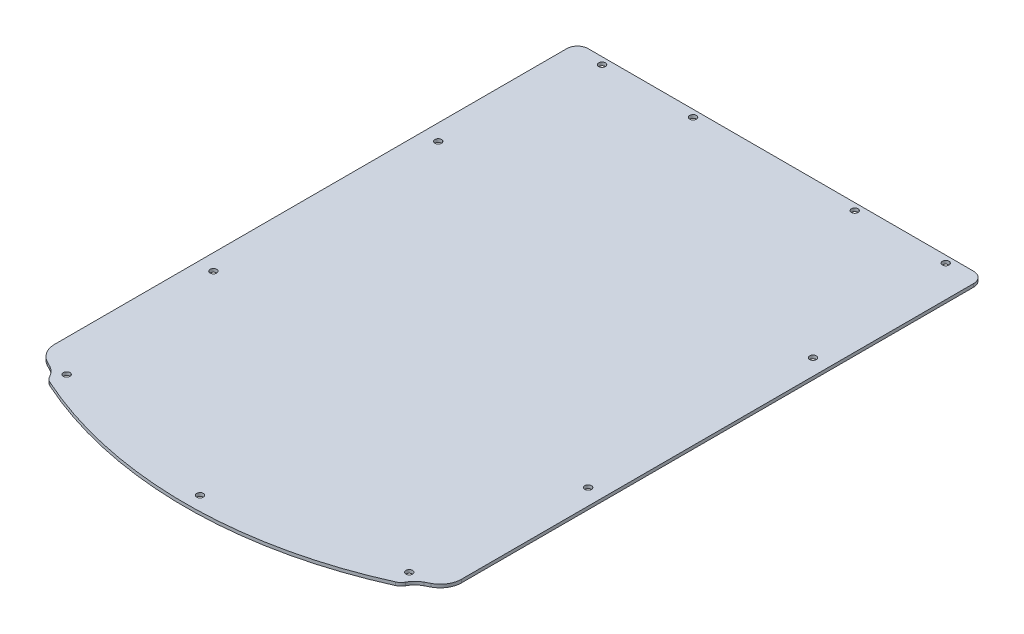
ISO-10303-21;
HEADER;
FILE_DESCRIPTION(('STEP AP214'),'2;1');
FILE_NAME('part.step','',(''),(''),'','','');
FILE_SCHEMA(('AUTOMOTIVE_DESIGN { 1 0 10303 214 1 1 1 1 }'));
ENDSEC;
DATA;
#1=APPLICATION_CONTEXT('core data for automotive mechanical design processes');
#2=APPLICATION_PROTOCOL_DEFINITION('international standard','automotive_design',2000,#1);
#3=PRODUCT_CONTEXT('',#1,'mechanical');
#4=PRODUCT('Part','Part','',(#3));
#5=PRODUCT_RELATED_PRODUCT_CATEGORY('part','',(#4));
#6=PRODUCT_DEFINITION_FORMATION('','',#4);
#7=PRODUCT_DEFINITION_CONTEXT('part definition',#1,'design');
#8=PRODUCT_DEFINITION('design','',#6,#7);
#9=PRODUCT_DEFINITION_SHAPE('','',#8);
#10=(LENGTH_UNIT() NAMED_UNIT(*) SI_UNIT(.MILLI.,.METRE.));
#11=(NAMED_UNIT(*) PLANE_ANGLE_UNIT() SI_UNIT($,.RADIAN.));
#12=(NAMED_UNIT(*) SI_UNIT($,.STERADIAN.) SOLID_ANGLE_UNIT());
#13=UNCERTAINTY_MEASURE_WITH_UNIT(LENGTH_MEASURE(1.E-05),#10,'distance_accuracy_value','');
#14=(GEOMETRIC_REPRESENTATION_CONTEXT(3) GLOBAL_UNCERTAINTY_ASSIGNED_CONTEXT((#13)) GLOBAL_UNIT_ASSIGNED_CONTEXT((#10,
#11,#12)) REPRESENTATION_CONTEXT('',''));
#15=CARTESIAN_POINT('',(0.,0.,0.));
#16=DIRECTION('',(0.,0.,1.));
#17=DIRECTION('',(1.,0.,0.));
#18=AXIS2_PLACEMENT_3D('',#15,#16,#17);
#19=CARTESIAN_POINT('',(0.,-1.5,-42.9999999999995));
#20=DIRECTION('',(0.,1.,0.));
#21=DIRECTION('',(0.,0.,1.));
#22=AXIS2_PLACEMENT_3D('',#19,#20,#21);
#23=CYLINDRICAL_SURFACE('',#22,193.);
#24=CARTESIAN_POINT('',(0.,-1.5,-42.9999999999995));
#25=DIRECTION('',(0.,1.,0.));
#26=DIRECTION('',(0.,0.,1.));
#27=AXIS2_PLACEMENT_3D('',#24,#25,#26);
#28=CIRCLE('',#27,193.);
#29=CARTESIAN_POINT('',(-89.6448087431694,-1.5,127.917548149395));
#30=VERTEX_POINT('',#29);
#31=CARTESIAN_POINT('',(-87.4520577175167,-1.5,129.049811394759));
#32=VERTEX_POINT('',#31);
#33=EDGE_CURVE('E302',#30,#32,#28,.T.);
#34=ORIENTED_EDGE('',*,*,#33,.T.);
#35=DIRECTION('',(0.,1.,0.));
#36=VECTOR('',#35,1.);
#37=CARTESIAN_POINT('',(-87.4520577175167,-1.5,129.049811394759));
#38=LINE('',#37,#36);
#39=CARTESIAN_POINT('',(-87.4520577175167,0.,129.049811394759));
#40=VERTEX_POINT('',#39);
#41=EDGE_CURVE('E169',#32,#40,#38,.T.);
#42=ORIENTED_EDGE('',*,*,#41,.T.);
#43=CARTESIAN_POINT('',(0.,0.,-42.9999999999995));
#44=DIRECTION('',(0.,1.,0.));
#45=DIRECTION('',(0.,0.,1.));
#46=AXIS2_PLACEMENT_3D('',#43,#44,#45);
#47=CIRCLE('',#46,193.);
#48=CARTESIAN_POINT('',(-89.6448087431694,0.,127.917548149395));
#49=VERTEX_POINT('',#48);
#50=EDGE_CURVE('E152',#49,#40,#47,.T.);
#51=ORIENTED_EDGE('',*,*,#50,.F.);
#52=DIRECTION('',(0.,1.,0.));
#53=VECTOR('',#52,1.);
#54=CARTESIAN_POINT('',(-89.6448087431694,-1.5,127.917548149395));
#55=LINE('',#54,#53);
#56=EDGE_CURVE('E166',#49,#30,#55,.F.);
#57=ORIENTED_EDGE('',*,*,#56,.T.);
#58=EDGE_LOOP('',(#34,#42,#51,#57));
#59=FACE_BOUND('',#58,.T.);
#60=ADVANCED_FACE('F44',(#59),#23,.T.);
#61=CARTESIAN_POINT('',(-94.9999999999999,-1.5,125.));
#62=DIRECTION('',(-1.,0.,0.));
#63=DIRECTION('',(0.,0.,1.));
#64=AXIS2_PLACEMENT_3D('',#61,#62,#63);
#65=PLANE('',#64);
#66=DIRECTION('',(0.,0.,1.));
#67=VECTOR('',#66,1.);
#68=CARTESIAN_POINT('',(-94.9999999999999,0.,125.));
#69=LINE('',#68,#67);
#70=CARTESIAN_POINT('',(-95.0000000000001,0.,-120.));
#71=VERTEX_POINT('',#70);
#72=CARTESIAN_POINT('',(-94.9999999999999,0.,119.061716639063));
#73=VERTEX_POINT('',#72);
#74=EDGE_CURVE('E154',#71,#73,#69,.T.);
#75=ORIENTED_EDGE('',*,*,#74,.F.);
#76=DIRECTION('',(0.,1.,0.));
#77=VECTOR('',#76,1.);
#78=CARTESIAN_POINT('',(-95.0000000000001,-1.5,-120.));
#79=LINE('',#78,#77);
#80=CARTESIAN_POINT('',(-95.0000000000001,-1.5,-120.));
#81=VERTEX_POINT('',#80);
#82=EDGE_CURVE('E255',#71,#81,#79,.F.);
#83=ORIENTED_EDGE('',*,*,#82,.T.);
#84=DIRECTION('',(0.,0.,1.));
#85=VECTOR('',#84,1.);
#86=CARTESIAN_POINT('',(-94.9999999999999,-1.5,125.));
#87=LINE('',#86,#85);
#88=CARTESIAN_POINT('',(-94.9999999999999,-1.5,119.061716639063));
#89=VERTEX_POINT('',#88);
#90=EDGE_CURVE('E297',#81,#89,#87,.T.);
#91=ORIENTED_EDGE('',*,*,#90,.T.);
#92=DIRECTION('',(0.,1.,0.));
#93=VECTOR('',#92,1.);
#94=CARTESIAN_POINT('',(-94.9999999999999,-1.5,119.061716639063));
#95=LINE('',#94,#93);
#96=EDGE_CURVE('E198',#89,#73,#95,.T.);
#97=ORIENTED_EDGE('',*,*,#96,.T.);
#98=EDGE_LOOP('',(#75,#83,#91,#97));
#99=FACE_BOUND('',#98,.T.);
#100=ADVANCED_FACE('F344',(#99),#65,.T.);
#101=CARTESIAN_POINT('',(94.9999999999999,-1.5,-125.));
#102=DIRECTION('',(0.,0.,-1.));
#103=DIRECTION('',(-1.,0.,0.));
#104=AXIS2_PLACEMENT_3D('',#101,#102,#103);
#105=PLANE('',#104);
#106=DIRECTION('',(-1.,0.,0.));
#107=VECTOR('',#106,1.);
#108=CARTESIAN_POINT('',(94.9999999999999,0.,-125.));
#109=LINE('',#108,#107);
#110=CARTESIAN_POINT('',(89.9999999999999,0.,-125.));
#111=VERTEX_POINT('',#110);
#112=CARTESIAN_POINT('',(-90.0000000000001,0.,-125.));
#113=VERTEX_POINT('',#112);
#114=EDGE_CURVE('E189',#111,#113,#109,.T.);
#115=ORIENTED_EDGE('',*,*,#114,.F.);
#116=DIRECTION('',(0.,1.,0.));
#117=VECTOR('',#116,1.);
#118=CARTESIAN_POINT('',(89.9999999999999,-1.5,-125.));
#119=LINE('',#118,#117);
#120=CARTESIAN_POINT('',(89.9999999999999,-1.5,-125.));
#121=VERTEX_POINT('',#120);
#122=EDGE_CURVE('E242',#111,#121,#119,.F.);
#123=ORIENTED_EDGE('',*,*,#122,.T.);
#124=DIRECTION('',(-1.,0.,0.));
#125=VECTOR('',#124,1.);
#126=CARTESIAN_POINT('',(94.9999999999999,-1.5,-125.));
#127=LINE('',#126,#125);
#128=CARTESIAN_POINT('',(-90.0000000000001,-1.5,-125.));
#129=VERTEX_POINT('',#128);
#130=EDGE_CURVE('E179',#121,#129,#127,.T.);
#131=ORIENTED_EDGE('',*,*,#130,.T.);
#132=DIRECTION('',(0.,1.,0.));
#133=VECTOR('',#132,1.);
#134=CARTESIAN_POINT('',(-90.0000000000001,-1.5,-125.));
#135=LINE('',#134,#133);
#136=EDGE_CURVE('E238',#129,#113,#135,.T.);
#137=ORIENTED_EDGE('',*,*,#136,.T.);
#138=EDGE_LOOP('',(#115,#123,#131,#137));
#139=FACE_BOUND('',#138,.T.);
#140=ADVANCED_FACE('F316',(#139),#105,.T.);
#141=CARTESIAN_POINT('',(94.9999999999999,-1.5,125.));
#142=DIRECTION('',(1.,0.,0.));
#143=DIRECTION('',(0.,0.,-1.));
#144=AXIS2_PLACEMENT_3D('',#141,#142,#143);
#145=PLANE('',#144);
#146=DIRECTION('',(0.,0.,-1.));
#147=VECTOR('',#146,1.);
#148=CARTESIAN_POINT('',(94.9999999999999,-1.5,125.));
#149=LINE('',#148,#147);
#150=CARTESIAN_POINT('',(94.9999999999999,-1.5,119.061716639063));
#151=VERTEX_POINT('',#150);
#152=CARTESIAN_POINT('',(94.9999999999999,-1.5,-120.));
#153=VERTEX_POINT('',#152);
#154=EDGE_CURVE('E186',#151,#153,#149,.T.);
#155=ORIENTED_EDGE('',*,*,#154,.T.);
#156=DIRECTION('',(0.,1.,0.));
#157=VECTOR('',#156,1.);
#158=CARTESIAN_POINT('',(94.9999999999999,-1.5,-120.));
#159=LINE('',#158,#157);
#160=CARTESIAN_POINT('',(94.9999999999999,0.,-120.));
#161=VERTEX_POINT('',#160);
#162=EDGE_CURVE('E222',#153,#161,#159,.T.);
#163=ORIENTED_EDGE('',*,*,#162,.T.);
#164=DIRECTION('',(0.,0.,-1.));
#165=VECTOR('',#164,1.);
#166=CARTESIAN_POINT('',(94.9999999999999,0.,125.));
#167=LINE('',#166,#165);
#168=CARTESIAN_POINT('',(94.9999999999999,0.,119.061716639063));
#169=VERTEX_POINT('',#168);
#170=EDGE_CURVE('E171',#169,#161,#167,.T.);
#171=ORIENTED_EDGE('',*,*,#170,.F.);
#172=DIRECTION('',(0.,1.,0.));
#173=VECTOR('',#172,1.);
#174=CARTESIAN_POINT('',(94.9999999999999,-1.5,119.061716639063));
#175=LINE('',#174,#173);
#176=EDGE_CURVE('E207',#169,#151,#175,.F.);
#177=ORIENTED_EDGE('',*,*,#176,.T.);
#178=EDGE_LOOP('',(#155,#163,#171,#177));
#179=FACE_BOUND('',#178,.T.);
#180=ADVANCED_FACE('F325',(#179),#145,.T.);
#181=CARTESIAN_POINT('',(87.4520577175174,0.,129.049811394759));
#182=VERTEX_POINT('',#181);
#183=CARTESIAN_POINT('',(89.6448087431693,0.,127.917548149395));
#184=VERTEX_POINT('',#183);
#185=EDGE_CURVE('E172',#182,#184,#47,.T.);
#186=ORIENTED_EDGE('',*,*,#185,.F.);
#187=DIRECTION('',(0.,1.,0.));
#188=VECTOR('',#187,1.);
#189=CARTESIAN_POINT('',(87.4520577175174,-1.5,129.049811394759));
#190=LINE('',#189,#188);
#191=CARTESIAN_POINT('',(87.4520577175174,-1.5,129.049811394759));
#192=VERTEX_POINT('',#191);
#193=EDGE_CURVE('E195',#182,#192,#190,.F.);
#194=ORIENTED_EDGE('',*,*,#193,.T.);
#195=CARTESIAN_POINT('',(89.6448087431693,-1.5,127.917548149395));
#196=VERTEX_POINT('',#195);
#197=EDGE_CURVE('E276',#192,#196,#28,.T.);
#198=ORIENTED_EDGE('',*,*,#197,.T.);
#199=DIRECTION('',(0.,1.,0.));
#200=VECTOR('',#199,1.);
#201=CARTESIAN_POINT('',(89.6448087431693,-1.5,127.917548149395));
#202=LINE('',#201,#200);
#203=EDGE_CURVE('E183',#196,#184,#202,.T.);
#204=ORIENTED_EDGE('',*,*,#203,.T.);
#205=EDGE_LOOP('',(#186,#194,#198,#204));
#206=FACE_BOUND('',#205,.T.);
#207=ADVANCED_FACE('F332',(#206),#23,.T.);
#208=CARTESIAN_POINT('',(0.,-1.5,-42.9999999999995));
#209=DIRECTION('',(0.,1.,0.));
#210=DIRECTION('',(0.,0.,1.));
#211=AXIS2_PLACEMENT_3D('',#208,#209,#210);
#212=PLANE('',#211);
#213=CARTESIAN_POINT('',(-87.5000000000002,-1.5,52.5000000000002));
#214=DIRECTION('',(0.,-1.,0.));
#215=DIRECTION('',(0.,0.,-1.));
#216=AXIS2_PLACEMENT_3D('',#213,#214,#215);
#217=CIRCLE('',#216,1.54999999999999);
#218=CARTESIAN_POINT('',(-87.5000000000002,-1.5,50.9500000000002));
#219=VERTEX_POINT('',#218);
#220=EDGE_CURVE('E499',#219,#219,#217,.T.);
#221=ORIENTED_EDGE('',*,*,#220,.F.);
#222=EDGE_LOOP('',(#221));
#223=FACE_BOUND('',#222,.T.);
#224=CARTESIAN_POINT('',(-87.5000000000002,-1.5,-52.4999999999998));
#225=DIRECTION('',(0.,-1.,0.));
#226=DIRECTION('',(0.,0.,-1.));
#227=AXIS2_PLACEMENT_3D('',#224,#225,#226);
#228=CIRCLE('',#227,1.54999999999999);
#229=CARTESIAN_POINT('',(-87.5000000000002,-1.5,-54.0499999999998));
#230=VERTEX_POINT('',#229);
#231=EDGE_CURVE('E493',#230,#230,#228,.T.);
#232=ORIENTED_EDGE('',*,*,#231,.F.);
#233=EDGE_LOOP('',(#232));
#234=FACE_BOUND('',#233,.T.);
#235=CARTESIAN_POINT('',(-80.2500000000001,-1.5,-121.75));
#236=DIRECTION('',(0.,-1.,0.));
#237=DIRECTION('',(0.,0.,-1.));
#238=AXIS2_PLACEMENT_3D('',#235,#236,#237);
#239=CIRCLE('',#238,1.54999999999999);
#240=CARTESIAN_POINT('',(-80.2500000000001,-1.5,-123.3));
#241=VERTEX_POINT('',#240);
#242=EDGE_CURVE('E487',#241,#241,#239,.T.);
#243=ORIENTED_EDGE('',*,*,#242,.F.);
#244=EDGE_LOOP('',(#243));
#245=FACE_BOUND('',#244,.T.);
#246=CARTESIAN_POINT('',(-37.7500000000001,-1.5,-121.75));
#247=DIRECTION('',(0.,-1.,0.));
#248=DIRECTION('',(0.,0.,-1.));
#249=AXIS2_PLACEMENT_3D('',#246,#247,#248);
#250=CIRCLE('',#249,1.55);
#251=CARTESIAN_POINT('',(-37.7500000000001,-1.5,-123.3));
#252=VERTEX_POINT('',#251);
#253=EDGE_CURVE('E481',#252,#252,#250,.T.);
#254=ORIENTED_EDGE('',*,*,#253,.F.);
#255=EDGE_LOOP('',(#254));
#256=FACE_BOUND('',#255,.T.);
#257=CARTESIAN_POINT('',(37.7499999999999,-1.5,-121.75));
#258=DIRECTION('',(0.,-1.,0.));
#259=DIRECTION('',(0.,0.,-1.));
#260=AXIS2_PLACEMENT_3D('',#257,#258,#259);
#261=CIRCLE('',#260,1.55);
#262=CARTESIAN_POINT('',(37.7499999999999,-1.5,-123.3));
#263=VERTEX_POINT('',#262);
#264=EDGE_CURVE('E475',#263,#263,#261,.T.);
#265=ORIENTED_EDGE('',*,*,#264,.F.);
#266=EDGE_LOOP('',(#265));
#267=FACE_BOUND('',#266,.T.);
#268=CARTESIAN_POINT('',(80.2499999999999,-1.5,-121.75));
#269=DIRECTION('',(0.,-1.,0.));
#270=DIRECTION('',(0.,0.,-1.));
#271=AXIS2_PLACEMENT_3D('',#268,#269,#270);
#272=CIRCLE('',#271,1.54999999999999);
#273=CARTESIAN_POINT('',(80.2499999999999,-1.5,-123.3));
#274=VERTEX_POINT('',#273);
#275=EDGE_CURVE('E469',#274,#274,#272,.T.);
#276=ORIENTED_EDGE('',*,*,#275,.F.);
#277=EDGE_LOOP('',(#276));
#278=FACE_BOUND('',#277,.T.);
#279=CARTESIAN_POINT('',(87.5000000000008,-1.5,-52.4999999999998));
#280=DIRECTION('',(0.,-1.,0.));
#281=DIRECTION('',(0.,0.,-1.));
#282=AXIS2_PLACEMENT_3D('',#279,#280,#281);
#283=CIRCLE('',#282,1.54999999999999);
#284=CARTESIAN_POINT('',(87.5000000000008,-1.5,-54.0499999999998));
#285=VERTEX_POINT('',#284);
#286=EDGE_CURVE('E463',#285,#285,#283,.T.);
#287=ORIENTED_EDGE('',*,*,#286,.F.);
#288=EDGE_LOOP('',(#287));
#289=FACE_BOUND('',#288,.T.);
#290=CARTESIAN_POINT('',(87.5000000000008,-1.5,52.5000000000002));
#291=DIRECTION('',(0.,-1.,0.));
#292=DIRECTION('',(0.,0.,-1.));
#293=AXIS2_PLACEMENT_3D('',#290,#291,#292);
#294=CIRCLE('',#293,1.54999999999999);
#295=CARTESIAN_POINT('',(87.5000000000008,-1.5,50.9500000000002));
#296=VERTEX_POINT('',#295);
#297=EDGE_CURVE('E457',#296,#296,#294,.T.);
#298=ORIENTED_EDGE('',*,*,#297,.F.);
#299=EDGE_LOOP('',(#298));
#300=FACE_BOUND('',#299,.T.);
#301=CARTESIAN_POINT('',(79.9805060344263,-1.5,128.518748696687));
#302=DIRECTION('',(0.,-1.,0.));
#303=DIRECTION('',(0.,0.,-1.));
#304=AXIS2_PLACEMENT_3D('',#301,#302,#303);
#305=CIRCLE('',#304,1.54999999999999);
#306=CARTESIAN_POINT('',(79.9805060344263,-1.5,126.968748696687));
#307=VERTEX_POINT('',#306);
#308=EDGE_CURVE('E446',#307,#307,#305,.T.);
#309=ORIENTED_EDGE('',*,*,#308,.F.);
#310=EDGE_LOOP('',(#309));
#311=FACE_BOUND('',#310,.T.);
#312=CARTESIAN_POINT('',(0.,-1.5,146.25));
#313=DIRECTION('',(0.,-1.,0.));
#314=DIRECTION('',(0.,0.,-1.));
#315=AXIS2_PLACEMENT_3D('',#312,#313,#314);
#316=CIRCLE('',#315,1.55);
#317=CARTESIAN_POINT('',(0.,-1.5,144.7));
#318=VERTEX_POINT('',#317);
#319=EDGE_CURVE('E445',#318,#318,#316,.T.);
#320=ORIENTED_EDGE('',*,*,#319,.F.);
#321=EDGE_LOOP('',(#320));
#322=FACE_BOUND('',#321,.T.);
#323=CARTESIAN_POINT('',(-79.9805060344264,-1.5,128.518748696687));
#324=DIRECTION('',(0.,-1.,0.));
#325=DIRECTION('',(0.,0.,-1.));
#326=AXIS2_PLACEMENT_3D('',#323,#324,#325);
#327=CIRCLE('',#326,1.54999999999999);
#328=CARTESIAN_POINT('',(-79.9805060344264,-1.5,126.968748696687));
#329=VERTEX_POINT('',#328);
#330=EDGE_CURVE('E293',#329,#329,#327,.T.);
#331=ORIENTED_EDGE('',*,*,#330,.F.);
#332=EDGE_LOOP('',(#331));
#333=FACE_BOUND('',#332,.T.);
#334=ORIENTED_EDGE('',*,*,#130,.F.);
#335=CARTESIAN_POINT('',(89.9999999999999,-1.5,-120.));
#336=DIRECTION('',(0.,1.,0.));
#337=DIRECTION('',(0.,0.,1.));
#338=AXIS2_PLACEMENT_3D('',#335,#336,#337);
#339=CIRCLE('',#338,5.);
#340=EDGE_CURVE('E252',#121,#153,#339,.F.);
#341=ORIENTED_EDGE('',*,*,#340,.T.);
#342=ORIENTED_EDGE('',*,*,#154,.F.);
#343=CARTESIAN_POINT('',(84.9999999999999,-1.5,119.061716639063));
#344=DIRECTION('',(0.,1.,0.));
#345=DIRECTION('',(0.,0.,1.));
#346=AXIS2_PLACEMENT_3D('',#343,#344,#345);
#347=CIRCLE('',#346,10.);
#348=EDGE_CURVE('E160',#151,#196,#347,.F.);
#349=ORIENTED_EDGE('',*,*,#348,.T.);
#350=ORIENTED_EDGE('',*,*,#197,.F.);
#351=CARTESIAN_POINT('',(91.9832524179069,-1.5,137.964309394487));
#352=DIRECTION('',(0.,1.,0.));
#353=DIRECTION('',(0.,0.,1.));
#354=AXIS2_PLACEMENT_3D('',#351,#352,#353);
#355=CIRCLE('',#354,10.);
#356=CARTESIAN_POINT('',(83.1111833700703,-1.5,133.35059171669));
#357=VERTEX_POINT('',#356);
#358=EDGE_CURVE('E219',#192,#357,#355,.T.);
#359=ORIENTED_EDGE('',*,*,#358,.T.);
#360=CARTESIAN_POINT('',(78.6751488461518,-1.5,131.043732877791));
#361=DIRECTION('',(0.,1.,0.));
#362=DIRECTION('',(0.,0.,1.));
#363=AXIS2_PLACEMENT_3D('',#360,#361,#362);
#364=CIRCLE('',#363,5.);
#365=CARTESIAN_POINT('',(80.73470771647,-1.5,135.599851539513));
#366=VERTEX_POINT('',#365);
#367=EDGE_CURVE('E66',#357,#366,#364,.F.);
#368=ORIENTED_EDGE('',*,*,#367,.T.);
#369=CARTESIAN_POINT('',(0.,-1.5,-42.9999999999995));
#370=DIRECTION('',(0.,1.,0.));
#371=DIRECTION('',(0.,0.,1.));
#372=AXIS2_PLACEMENT_3D('',#369,#370,#371);
#373=CIRCLE('',#372,196.);
#374=CARTESIAN_POINT('',(-80.7347077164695,-1.5,135.599851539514));
#375=VERTEX_POINT('',#374);
#376=EDGE_CURVE('E285',#375,#366,#373,.T.);
#377=ORIENTED_EDGE('',*,*,#376,.F.);
#378=CARTESIAN_POINT('',(-78.6751488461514,-1.5,131.043732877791));
#379=DIRECTION('',(0.,1.,0.));
#380=DIRECTION('',(0.,0.,1.));
#381=AXIS2_PLACEMENT_3D('',#378,#379,#380);
#382=CIRCLE('',#381,5.);
#383=CARTESIAN_POINT('',(-83.1111833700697,-1.5,133.35059171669));
#384=VERTEX_POINT('',#383);
#385=EDGE_CURVE('E60',#375,#384,#382,.F.);
#386=ORIENTED_EDGE('',*,*,#385,.T.);
#387=CARTESIAN_POINT('',(-91.9832524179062,-1.5,137.964309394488));
#388=DIRECTION('',(0.,1.,0.));
#389=DIRECTION('',(0.,0.,1.));
#390=AXIS2_PLACEMENT_3D('',#387,#388,#389);
#391=CIRCLE('',#390,10.);
#392=EDGE_CURVE('E213',#384,#32,#391,.T.);
#393=ORIENTED_EDGE('',*,*,#392,.T.);
#394=ORIENTED_EDGE('',*,*,#33,.F.);
#395=CARTESIAN_POINT('',(-85.,-1.5,119.061716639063));
#396=DIRECTION('',(0.,1.,0.));
#397=DIRECTION('',(0.,0.,1.));
#398=AXIS2_PLACEMENT_3D('',#395,#396,#397);
#399=CIRCLE('',#398,10.);
#400=EDGE_CURVE('E177',#30,#89,#399,.F.);
#401=ORIENTED_EDGE('',*,*,#400,.T.);
#402=ORIENTED_EDGE('',*,*,#90,.F.);
#403=CARTESIAN_POINT('',(-90.0000000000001,-1.5,-120.));
#404=DIRECTION('',(0.,1.,0.));
#405=DIRECTION('',(0.,0.,1.));
#406=AXIS2_PLACEMENT_3D('',#403,#404,#405);
#407=CIRCLE('',#406,5.);
#408=EDGE_CURVE('E249',#81,#129,#407,.F.);
#409=ORIENTED_EDGE('',*,*,#408,.T.);
#410=EDGE_LOOP('',(#334,#341,#342,#349,#350,#359,#368,#377,#386,#393,#394,#401,#402,#409));
#411=FACE_BOUND('',#410,.T.);
#412=ADVANCED_FACE('F274',(#223,#234,#245,#256,#267,#278,#289,#300,#311,#322,#333,#411),#212,.F.);
#413=CARTESIAN_POINT('',(0.,0.,-42.9999999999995));
#414=DIRECTION('',(0.,1.,0.));
#415=DIRECTION('',(0.,0.,1.));
#416=AXIS2_PLACEMENT_3D('',#413,#414,#415);
#417=PLANE('',#416);
#418=CARTESIAN_POINT('',(-87.5000000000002,0.,52.5000000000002));
#419=DIRECTION('',(0.,-1.,0.));
#420=DIRECTION('',(0.,0.,-1.));
#421=AXIS2_PLACEMENT_3D('',#418,#419,#420);
#422=CIRCLE('',#421,1.54999999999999);
#423=CARTESIAN_POINT('',(-87.5000000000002,0.,50.9500000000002));
#424=VERTEX_POINT('',#423);
#425=EDGE_CURVE('E407',#424,#424,#422,.T.);
#426=ORIENTED_EDGE('',*,*,#425,.T.);
#427=EDGE_LOOP('',(#426));
#428=FACE_BOUND('',#427,.T.);
#429=CARTESIAN_POINT('',(-87.5000000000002,0.,-52.4999999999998));
#430=DIRECTION('',(0.,-1.,0.));
#431=DIRECTION('',(0.,0.,-1.));
#432=AXIS2_PLACEMENT_3D('',#429,#430,#431);
#433=CIRCLE('',#432,1.54999999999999);
#434=CARTESIAN_POINT('',(-87.5000000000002,0.,-54.0499999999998));
#435=VERTEX_POINT('',#434);
#436=EDGE_CURVE('E411',#435,#435,#433,.T.);
#437=ORIENTED_EDGE('',*,*,#436,.T.);
#438=EDGE_LOOP('',(#437));
#439=FACE_BOUND('',#438,.T.);
#440=CARTESIAN_POINT('',(-80.2500000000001,0.,-121.75));
#441=DIRECTION('',(0.,-1.,0.));
#442=DIRECTION('',(0.,0.,-1.));
#443=AXIS2_PLACEMENT_3D('',#440,#441,#442);
#444=CIRCLE('',#443,1.54999999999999);
#445=CARTESIAN_POINT('',(-80.2500000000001,0.,-123.3));
#446=VERTEX_POINT('',#445);
#447=EDGE_CURVE('E415',#446,#446,#444,.T.);
#448=ORIENTED_EDGE('',*,*,#447,.T.);
#449=EDGE_LOOP('',(#448));
#450=FACE_BOUND('',#449,.T.);
#451=CARTESIAN_POINT('',(-37.7500000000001,0.,-121.75));
#452=DIRECTION('',(0.,-1.,0.));
#453=DIRECTION('',(0.,0.,-1.));
#454=AXIS2_PLACEMENT_3D('',#451,#452,#453);
#455=CIRCLE('',#454,1.55);
#456=CARTESIAN_POINT('',(-37.7500000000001,0.,-123.3));
#457=VERTEX_POINT('',#456);
#458=EDGE_CURVE('E419',#457,#457,#455,.T.);
#459=ORIENTED_EDGE('',*,*,#458,.T.);
#460=EDGE_LOOP('',(#459));
#461=FACE_BOUND('',#460,.T.);
#462=CARTESIAN_POINT('',(37.7499999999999,0.,-121.75));
#463=DIRECTION('',(0.,-1.,0.));
#464=DIRECTION('',(0.,0.,-1.));
#465=AXIS2_PLACEMENT_3D('',#462,#463,#464);
#466=CIRCLE('',#465,1.55);
#467=CARTESIAN_POINT('',(37.7499999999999,0.,-123.3));
#468=VERTEX_POINT('',#467);
#469=EDGE_CURVE('E423',#468,#468,#466,.T.);
#470=ORIENTED_EDGE('',*,*,#469,.T.);
#471=EDGE_LOOP('',(#470));
#472=FACE_BOUND('',#471,.T.);
#473=CARTESIAN_POINT('',(80.2499999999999,0.,-121.75));
#474=DIRECTION('',(0.,-1.,0.));
#475=DIRECTION('',(0.,0.,-1.));
#476=AXIS2_PLACEMENT_3D('',#473,#474,#475);
#477=CIRCLE('',#476,1.54999999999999);
#478=CARTESIAN_POINT('',(80.2499999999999,0.,-123.3));
#479=VERTEX_POINT('',#478);
#480=EDGE_CURVE('E427',#479,#479,#477,.T.);
#481=ORIENTED_EDGE('',*,*,#480,.T.);
#482=EDGE_LOOP('',(#481));
#483=FACE_BOUND('',#482,.T.);
#484=CARTESIAN_POINT('',(87.5000000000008,0.,-52.4999999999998));
#485=DIRECTION('',(0.,-1.,0.));
#486=DIRECTION('',(0.,0.,-1.));
#487=AXIS2_PLACEMENT_3D('',#484,#485,#486);
#488=CIRCLE('',#487,1.54999999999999);
#489=CARTESIAN_POINT('',(87.5000000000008,0.,-54.0499999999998));
#490=VERTEX_POINT('',#489);
#491=EDGE_CURVE('E431',#490,#490,#488,.T.);
#492=ORIENTED_EDGE('',*,*,#491,.T.);
#493=EDGE_LOOP('',(#492));
#494=FACE_BOUND('',#493,.T.);
#495=CARTESIAN_POINT('',(87.5000000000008,0.,52.5000000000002));
#496=DIRECTION('',(0.,-1.,0.));
#497=DIRECTION('',(0.,0.,-1.));
#498=AXIS2_PLACEMENT_3D('',#495,#496,#497);
#499=CIRCLE('',#498,1.54999999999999);
#500=CARTESIAN_POINT('',(87.5000000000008,0.,50.9500000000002));
#501=VERTEX_POINT('',#500);
#502=EDGE_CURVE('E435',#501,#501,#499,.T.);
#503=ORIENTED_EDGE('',*,*,#502,.T.);
#504=EDGE_LOOP('',(#503));
#505=FACE_BOUND('',#504,.T.);
#506=CARTESIAN_POINT('',(79.9805060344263,0.,128.518748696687));
#507=DIRECTION('',(0.,-1.,0.));
#508=DIRECTION('',(0.,0.,-1.));
#509=AXIS2_PLACEMENT_3D('',#506,#507,#508);
#510=CIRCLE('',#509,1.54999999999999);
#511=CARTESIAN_POINT('',(79.9805060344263,0.,126.968748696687));
#512=VERTEX_POINT('',#511);
#513=EDGE_CURVE('E439',#512,#512,#510,.T.);
#514=ORIENTED_EDGE('',*,*,#513,.T.);
#515=EDGE_LOOP('',(#514));
#516=FACE_BOUND('',#515,.T.);
#517=CARTESIAN_POINT('',(0.,0.,146.25));
#518=DIRECTION('',(0.,-1.,0.));
#519=DIRECTION('',(0.,0.,-1.));
#520=AXIS2_PLACEMENT_3D('',#517,#518,#519);
#521=CIRCLE('',#520,1.55);
#522=CARTESIAN_POINT('',(0.,0.,144.7));
#523=VERTEX_POINT('',#522);
#524=EDGE_CURVE('E443',#523,#523,#521,.T.);
#525=ORIENTED_EDGE('',*,*,#524,.T.);
#526=EDGE_LOOP('',(#525));
#527=FACE_BOUND('',#526,.T.);
#528=CARTESIAN_POINT('',(-79.9805060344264,0.,128.518748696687));
#529=DIRECTION('',(0.,-1.,0.));
#530=DIRECTION('',(0.,0.,-1.));
#531=AXIS2_PLACEMENT_3D('',#528,#529,#530);
#532=CIRCLE('',#531,1.54999999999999);
#533=CARTESIAN_POINT('',(-79.9805060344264,0.,126.968748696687));
#534=VERTEX_POINT('',#533);
#535=EDGE_CURVE('E287',#534,#534,#532,.T.);
#536=ORIENTED_EDGE('',*,*,#535,.T.);
#537=EDGE_LOOP('',(#536));
#538=FACE_BOUND('',#537,.T.);
#539=ORIENTED_EDGE('',*,*,#170,.T.);
#540=CARTESIAN_POINT('',(89.9999999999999,0.,-120.));
#541=DIRECTION('',(0.,1.,0.));
#542=DIRECTION('',(0.,0.,1.));
#543=AXIS2_PLACEMENT_3D('',#540,#541,#542);
#544=CIRCLE('',#543,5.);
#545=EDGE_CURVE('E235',#161,#111,#544,.T.);
#546=ORIENTED_EDGE('',*,*,#545,.T.);
#547=ORIENTED_EDGE('',*,*,#114,.T.);
#548=CARTESIAN_POINT('',(-90.0000000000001,0.,-120.));
#549=DIRECTION('',(0.,1.,0.));
#550=DIRECTION('',(0.,0.,1.));
#551=AXIS2_PLACEMENT_3D('',#548,#549,#550);
#552=CIRCLE('',#551,5.);
#553=EDGE_CURVE('E232',#113,#71,#552,.T.);
#554=ORIENTED_EDGE('',*,*,#553,.T.);
#555=ORIENTED_EDGE('',*,*,#74,.T.);
#556=CARTESIAN_POINT('',(-85.,0.,119.061716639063));
#557=DIRECTION('',(0.,1.,0.));
#558=DIRECTION('',(0.,0.,1.));
#559=AXIS2_PLACEMENT_3D('',#556,#557,#558);
#560=CIRCLE('',#559,10.);
#561=EDGE_CURVE('E147',#73,#49,#560,.T.);
#562=ORIENTED_EDGE('',*,*,#561,.T.);
#563=ORIENTED_EDGE('',*,*,#50,.T.);
#564=CARTESIAN_POINT('',(-91.9832524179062,0.,137.964309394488));
#565=DIRECTION('',(0.,1.,0.));
#566=DIRECTION('',(0.,0.,1.));
#567=AXIS2_PLACEMENT_3D('',#564,#565,#566);
#568=CIRCLE('',#567,10.);
#569=CARTESIAN_POINT('',(-83.1111833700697,0.,133.35059171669));
#570=VERTEX_POINT('',#569);
#571=EDGE_CURVE('E210',#40,#570,#568,.F.);
#572=ORIENTED_EDGE('',*,*,#571,.T.);
#573=CARTESIAN_POINT('',(-78.6751488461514,0.,131.043732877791));
#574=DIRECTION('',(0.,1.,0.));
#575=DIRECTION('',(0.,0.,1.));
#576=AXIS2_PLACEMENT_3D('',#573,#574,#575);
#577=CIRCLE('',#576,5.);
#578=CARTESIAN_POINT('',(-80.7347077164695,0.,135.599851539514));
#579=VERTEX_POINT('',#578);
#580=EDGE_CURVE('E226',#570,#579,#577,.T.);
#581=ORIENTED_EDGE('',*,*,#580,.T.);
#582=CARTESIAN_POINT('',(0.,0.,-42.9999999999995));
#583=DIRECTION('',(0.,1.,0.));
#584=DIRECTION('',(0.,0.,1.));
#585=AXIS2_PLACEMENT_3D('',#582,#583,#584);
#586=CIRCLE('',#585,196.);
#587=CARTESIAN_POINT('',(80.73470771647,0.,135.599851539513));
#588=VERTEX_POINT('',#587);
#589=EDGE_CURVE('E283',#579,#588,#586,.T.);
#590=ORIENTED_EDGE('',*,*,#589,.T.);
#591=CARTESIAN_POINT('',(78.6751488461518,0.,131.043732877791));
#592=DIRECTION('',(0.,1.,0.));
#593=DIRECTION('',(0.,0.,1.));
#594=AXIS2_PLACEMENT_3D('',#591,#592,#593);
#595=CIRCLE('',#594,5.);
#596=CARTESIAN_POINT('',(83.1111833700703,0.,133.35059171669));
#597=VERTEX_POINT('',#596);
#598=EDGE_CURVE('E229',#588,#597,#595,.T.);
#599=ORIENTED_EDGE('',*,*,#598,.T.);
#600=CARTESIAN_POINT('',(91.9832524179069,0.,137.964309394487));
#601=DIRECTION('',(0.,1.,0.));
#602=DIRECTION('',(0.,0.,1.));
#603=AXIS2_PLACEMENT_3D('',#600,#601,#602);
#604=CIRCLE('',#603,10.);
#605=EDGE_CURVE('E216',#597,#182,#604,.F.);
#606=ORIENTED_EDGE('',*,*,#605,.T.);
#607=ORIENTED_EDGE('',*,*,#185,.T.);
#608=CARTESIAN_POINT('',(84.9999999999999,0.,119.061716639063));
#609=DIRECTION('',(0.,1.,0.));
#610=DIRECTION('',(0.,0.,1.));
#611=AXIS2_PLACEMENT_3D('',#608,#609,#610);
#612=CIRCLE('',#611,10.);
#613=EDGE_CURVE('E161',#184,#169,#612,.T.);
#614=ORIENTED_EDGE('',*,*,#613,.T.);
#615=EDGE_LOOP('',(#539,#546,#547,#554,#555,#562,#563,#572,#581,#590,#599,#606,#607,#614));
#616=FACE_BOUND('',#615,.T.);
#617=ADVANCED_FACE('F150',(#428,#439,#450,#461,#472,#483,#494,#505,#516,#527,#538,#616),#417,.T.);
#618=CARTESIAN_POINT('',(0.,-1.5,-42.9999999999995));
#619=DIRECTION('',(0.,1.,0.));
#620=DIRECTION('',(0.,0.,1.));
#621=AXIS2_PLACEMENT_3D('',#618,#619,#620);
#622=CYLINDRICAL_SURFACE('',#621,196.);
#623=ORIENTED_EDGE('',*,*,#376,.T.);
#624=DIRECTION('',(0.,1.,0.));
#625=VECTOR('',#624,1.);
#626=CARTESIAN_POINT('',(80.73470771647,-1.5,135.599851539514));
#627=LINE('',#626,#625);
#628=EDGE_CURVE('E261',#366,#588,#627,.T.);
#629=ORIENTED_EDGE('',*,*,#628,.T.);
#630=ORIENTED_EDGE('',*,*,#589,.F.);
#631=DIRECTION('',(0.,1.,0.));
#632=VECTOR('',#631,1.);
#633=CARTESIAN_POINT('',(-80.7347077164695,-1.5,135.599851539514));
#634=LINE('',#633,#632);
#635=EDGE_CURVE('E258',#579,#375,#634,.F.);
#636=ORIENTED_EDGE('',*,*,#635,.T.);
#637=EDGE_LOOP('',(#623,#629,#630,#636));
#638=FACE_BOUND('',#637,.T.);
#639=ADVANCED_FACE('F282',(#638),#622,.T.);
#640=CARTESIAN_POINT('',(-91.9832524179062,-1.5,137.964309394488));
#641=DIRECTION('',(0.,-1.,0.));
#642=DIRECTION('',(0.,0.,-1.));
#643=AXIS2_PLACEMENT_3D('',#640,#641,#642);
#644=CYLINDRICAL_SURFACE('',#643,10.);
#645=ORIENTED_EDGE('',*,*,#392,.F.);
#646=DIRECTION('',(0.,-1.,0.));
#647=VECTOR('',#646,1.);
#648=CARTESIAN_POINT('',(-83.1111833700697,-1.5,133.35059171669));
#649=LINE('',#648,#647);
#650=EDGE_CURVE('E11',#384,#570,#649,.F.);
#651=ORIENTED_EDGE('',*,*,#650,.T.);
#652=ORIENTED_EDGE('',*,*,#571,.F.);
#653=ORIENTED_EDGE('',*,*,#41,.F.);
#654=EDGE_LOOP('',(#645,#651,#652,#653));
#655=FACE_BOUND('',#654,.T.);
#656=ADVANCED_FACE('F354',(#655),#644,.F.);
#657=CARTESIAN_POINT('',(91.9832524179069,-1.5,137.964309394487));
#658=DIRECTION('',(0.,-1.,0.));
#659=DIRECTION('',(0.,0.,-1.));
#660=AXIS2_PLACEMENT_3D('',#657,#658,#659);
#661=CYLINDRICAL_SURFACE('',#660,10.);
#662=ORIENTED_EDGE('',*,*,#605,.F.);
#663=DIRECTION('',(0.,-1.,0.));
#664=VECTOR('',#663,1.);
#665=CARTESIAN_POINT('',(83.1111833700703,-1.5,133.35059171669));
#666=LINE('',#665,#664);
#667=EDGE_CURVE('E53',#597,#357,#666,.T.);
#668=ORIENTED_EDGE('',*,*,#667,.T.);
#669=ORIENTED_EDGE('',*,*,#358,.F.);
#670=ORIENTED_EDGE('',*,*,#193,.F.);
#671=EDGE_LOOP('',(#662,#668,#669,#670));
#672=FACE_BOUND('',#671,.T.);
#673=ADVANCED_FACE('F269',(#672),#661,.F.);
#674=CARTESIAN_POINT('',(-85.,-1.5,119.061716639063));
#675=DIRECTION('',(0.,1.,0.));
#676=DIRECTION('',(0.,0.,1.));
#677=AXIS2_PLACEMENT_3D('',#674,#675,#676);
#678=CYLINDRICAL_SURFACE('',#677,10.);
#679=ORIENTED_EDGE('',*,*,#400,.F.);
#680=ORIENTED_EDGE('',*,*,#56,.F.);
#681=ORIENTED_EDGE('',*,*,#561,.F.);
#682=ORIENTED_EDGE('',*,*,#96,.F.);
#683=EDGE_LOOP('',(#679,#680,#681,#682));
#684=FACE_BOUND('',#683,.T.);
#685=ADVANCED_FACE('F175',(#684),#678,.T.);
#686=CARTESIAN_POINT('',(84.9999999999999,-1.5,119.061716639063));
#687=DIRECTION('',(0.,1.,0.));
#688=DIRECTION('',(0.,0.,1.));
#689=AXIS2_PLACEMENT_3D('',#686,#687,#688);
#690=CYLINDRICAL_SURFACE('',#689,10.);
#691=ORIENTED_EDGE('',*,*,#348,.F.);
#692=ORIENTED_EDGE('',*,*,#176,.F.);
#693=ORIENTED_EDGE('',*,*,#613,.F.);
#694=ORIENTED_EDGE('',*,*,#203,.F.);
#695=EDGE_LOOP('',(#691,#692,#693,#694));
#696=FACE_BOUND('',#695,.T.);
#697=ADVANCED_FACE('F328',(#696),#690,.T.);
#698=CARTESIAN_POINT('',(89.9999999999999,-1.5,-120.));
#699=DIRECTION('',(0.,1.,0.));
#700=DIRECTION('',(0.,0.,1.));
#701=AXIS2_PLACEMENT_3D('',#698,#699,#700);
#702=CYLINDRICAL_SURFACE('',#701,5.);
#703=ORIENTED_EDGE('',*,*,#340,.F.);
#704=ORIENTED_EDGE('',*,*,#122,.F.);
#705=ORIENTED_EDGE('',*,*,#545,.F.);
#706=ORIENTED_EDGE('',*,*,#162,.F.);
#707=EDGE_LOOP('',(#703,#704,#705,#706));
#708=FACE_BOUND('',#707,.T.);
#709=ADVANCED_FACE('F320',(#708),#702,.T.);
#710=CARTESIAN_POINT('',(-90.0000000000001,-1.5,-120.));
#711=DIRECTION('',(0.,1.,0.));
#712=DIRECTION('',(0.,0.,1.));
#713=AXIS2_PLACEMENT_3D('',#710,#711,#712);
#714=CYLINDRICAL_SURFACE('',#713,5.);
#715=ORIENTED_EDGE('',*,*,#408,.F.);
#716=ORIENTED_EDGE('',*,*,#82,.F.);
#717=ORIENTED_EDGE('',*,*,#553,.F.);
#718=ORIENTED_EDGE('',*,*,#136,.F.);
#719=EDGE_LOOP('',(#715,#716,#717,#718));
#720=FACE_BOUND('',#719,.T.);
#721=ADVANCED_FACE('F366',(#720),#714,.T.);
#722=CARTESIAN_POINT('',(78.6751488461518,-1.5,131.043732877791));
#723=DIRECTION('',(0.,-1.,0.));
#724=DIRECTION('',(0.,0.,-1.));
#725=AXIS2_PLACEMENT_3D('',#722,#723,#724);
#726=CYLINDRICAL_SURFACE('',#725,5.);
#727=ORIENTED_EDGE('',*,*,#367,.F.);
#728=ORIENTED_EDGE('',*,*,#667,.F.);
#729=ORIENTED_EDGE('',*,*,#598,.F.);
#730=ORIENTED_EDGE('',*,*,#628,.F.);
#731=EDGE_LOOP('',(#727,#728,#729,#730));
#732=FACE_BOUND('',#731,.T.);
#733=ADVANCED_FACE('F278',(#732),#726,.T.);
#734=CARTESIAN_POINT('',(-78.6751488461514,-1.5,131.043732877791));
#735=DIRECTION('',(0.,-1.,0.));
#736=DIRECTION('',(0.,0.,-1.));
#737=AXIS2_PLACEMENT_3D('',#734,#735,#736);
#738=CYLINDRICAL_SURFACE('',#737,5.);
#739=ORIENTED_EDGE('',*,*,#385,.F.);
#740=ORIENTED_EDGE('',*,*,#635,.F.);
#741=ORIENTED_EDGE('',*,*,#580,.F.);
#742=ORIENTED_EDGE('',*,*,#650,.F.);
#743=EDGE_LOOP('',(#739,#740,#741,#742));
#744=FACE_BOUND('',#743,.T.);
#745=ADVANCED_FACE('F46',(#744),#738,.T.);
#746=CARTESIAN_POINT('',(-79.9805060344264,0.,128.518748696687));
#747=DIRECTION('',(0.,-1.,0.));
#748=DIRECTION('',(0.,0.,-1.));
#749=AXIS2_PLACEMENT_3D('',#746,#747,#748);
#750=CYLINDRICAL_SURFACE('',#749,1.54999999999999);
#751=ORIENTED_EDGE('',*,*,#535,.F.);
#752=EDGE_LOOP('',(#751));
#753=FACE_BOUND('',#752,.T.);
#754=ORIENTED_EDGE('',*,*,#330,.T.);
#755=EDGE_LOOP('',(#754));
#756=FACE_BOUND('',#755,.T.);
#757=ADVANCED_FACE('F373',(#753,#756),#750,.F.);
#758=CARTESIAN_POINT('',(0.,0.,146.25));
#759=DIRECTION('',(0.,-1.,0.));
#760=DIRECTION('',(0.,0.,-1.));
#761=AXIS2_PLACEMENT_3D('',#758,#759,#760);
#762=CYLINDRICAL_SURFACE('',#761,1.55);
#763=ORIENTED_EDGE('',*,*,#524,.F.);
#764=EDGE_LOOP('',(#763));
#765=FACE_BOUND('',#764,.T.);
#766=ORIENTED_EDGE('',*,*,#319,.T.);
#767=EDGE_LOOP('',(#766));
#768=FACE_BOUND('',#767,.T.);
#769=ADVANCED_FACE('F378',(#765,#768),#762,.F.);
#770=CARTESIAN_POINT('',(79.9805060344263,0.,128.518748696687));
#771=DIRECTION('',(0.,-1.,0.));
#772=DIRECTION('',(0.,0.,-1.));
#773=AXIS2_PLACEMENT_3D('',#770,#771,#772);
#774=CYLINDRICAL_SURFACE('',#773,1.54999999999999);
#775=ORIENTED_EDGE('',*,*,#513,.F.);
#776=EDGE_LOOP('',(#775));
#777=FACE_BOUND('',#776,.T.);
#778=ORIENTED_EDGE('',*,*,#308,.T.);
#779=EDGE_LOOP('',(#778));
#780=FACE_BOUND('',#779,.T.);
#781=ADVANCED_FACE('F389',(#777,#780),#774,.F.);
#782=CARTESIAN_POINT('',(87.5000000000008,0.,52.5000000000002));
#783=DIRECTION('',(0.,-1.,0.));
#784=DIRECTION('',(0.,0.,-1.));
#785=AXIS2_PLACEMENT_3D('',#782,#783,#784);
#786=CYLINDRICAL_SURFACE('',#785,1.54999999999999);
#787=ORIENTED_EDGE('',*,*,#502,.F.);
#788=EDGE_LOOP('',(#787));
#789=FACE_BOUND('',#788,.T.);
#790=ORIENTED_EDGE('',*,*,#297,.T.);
#791=EDGE_LOOP('',(#790));
#792=FACE_BOUND('',#791,.T.);
#793=ADVANCED_FACE('F531',(#789,#792),#786,.F.);
#794=CARTESIAN_POINT('',(87.5000000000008,0.,-52.4999999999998));
#795=DIRECTION('',(0.,-1.,0.));
#796=DIRECTION('',(0.,0.,-1.));
#797=AXIS2_PLACEMENT_3D('',#794,#795,#796);
#798=CYLINDRICAL_SURFACE('',#797,1.54999999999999);
#799=ORIENTED_EDGE('',*,*,#491,.F.);
#800=EDGE_LOOP('',(#799));
#801=FACE_BOUND('',#800,.T.);
#802=ORIENTED_EDGE('',*,*,#286,.T.);
#803=EDGE_LOOP('',(#802));
#804=FACE_BOUND('',#803,.T.);
#805=ADVANCED_FACE('F537',(#801,#804),#798,.F.);
#806=CARTESIAN_POINT('',(80.2499999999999,0.,-121.75));
#807=DIRECTION('',(0.,-1.,0.));
#808=DIRECTION('',(0.,0.,-1.));
#809=AXIS2_PLACEMENT_3D('',#806,#807,#808);
#810=CYLINDRICAL_SURFACE('',#809,1.54999999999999);
#811=ORIENTED_EDGE('',*,*,#480,.F.);
#812=EDGE_LOOP('',(#811));
#813=FACE_BOUND('',#812,.T.);
#814=ORIENTED_EDGE('',*,*,#275,.T.);
#815=EDGE_LOOP('',(#814));
#816=FACE_BOUND('',#815,.T.);
#817=ADVANCED_FACE('F543',(#813,#816),#810,.F.);
#818=CARTESIAN_POINT('',(37.7499999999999,0.,-121.75));
#819=DIRECTION('',(0.,-1.,0.));
#820=DIRECTION('',(0.,0.,-1.));
#821=AXIS2_PLACEMENT_3D('',#818,#819,#820);
#822=CYLINDRICAL_SURFACE('',#821,1.55);
#823=ORIENTED_EDGE('',*,*,#469,.F.);
#824=EDGE_LOOP('',(#823));
#825=FACE_BOUND('',#824,.T.);
#826=ORIENTED_EDGE('',*,*,#264,.T.);
#827=EDGE_LOOP('',(#826));
#828=FACE_BOUND('',#827,.T.);
#829=ADVANCED_FACE('F547',(#825,#828),#822,.F.);
#830=CARTESIAN_POINT('',(-37.7500000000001,0.,-121.75));
#831=DIRECTION('',(0.,-1.,0.));
#832=DIRECTION('',(0.,0.,-1.));
#833=AXIS2_PLACEMENT_3D('',#830,#831,#832);
#834=CYLINDRICAL_SURFACE('',#833,1.55);
#835=ORIENTED_EDGE('',*,*,#458,.F.);
#836=EDGE_LOOP('',(#835));
#837=FACE_BOUND('',#836,.T.);
#838=ORIENTED_EDGE('',*,*,#253,.T.);
#839=EDGE_LOOP('',(#838));
#840=FACE_BOUND('',#839,.T.);
#841=ADVANCED_FACE('F551',(#837,#840),#834,.F.);
#842=CARTESIAN_POINT('',(-80.2500000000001,0.,-121.75));
#843=DIRECTION('',(0.,-1.,0.));
#844=DIRECTION('',(0.,0.,-1.));
#845=AXIS2_PLACEMENT_3D('',#842,#843,#844);
#846=CYLINDRICAL_SURFACE('',#845,1.54999999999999);
#847=ORIENTED_EDGE('',*,*,#447,.F.);
#848=EDGE_LOOP('',(#847));
#849=FACE_BOUND('',#848,.T.);
#850=ORIENTED_EDGE('',*,*,#242,.T.);
#851=EDGE_LOOP('',(#850));
#852=FACE_BOUND('',#851,.T.);
#853=ADVANCED_FACE('F555',(#849,#852),#846,.F.);
#854=CARTESIAN_POINT('',(-87.5000000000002,0.,-52.4999999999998));
#855=DIRECTION('',(0.,-1.,0.));
#856=DIRECTION('',(0.,0.,-1.));
#857=AXIS2_PLACEMENT_3D('',#854,#855,#856);
#858=CYLINDRICAL_SURFACE('',#857,1.54999999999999);
#859=ORIENTED_EDGE('',*,*,#436,.F.);
#860=EDGE_LOOP('',(#859));
#861=FACE_BOUND('',#860,.T.);
#862=ORIENTED_EDGE('',*,*,#231,.T.);
#863=EDGE_LOOP('',(#862));
#864=FACE_BOUND('',#863,.T.);
#865=ADVANCED_FACE('F558',(#861,#864),#858,.F.);
#866=CARTESIAN_POINT('',(-87.5000000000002,0.,52.5000000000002));
#867=DIRECTION('',(0.,-1.,0.));
#868=DIRECTION('',(0.,0.,-1.));
#869=AXIS2_PLACEMENT_3D('',#866,#867,#868);
#870=CYLINDRICAL_SURFACE('',#869,1.54999999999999);
#871=ORIENTED_EDGE('',*,*,#425,.F.);
#872=EDGE_LOOP('',(#871));
#873=FACE_BOUND('',#872,.T.);
#874=ORIENTED_EDGE('',*,*,#220,.T.);
#875=EDGE_LOOP('',(#874));
#876=FACE_BOUND('',#875,.T.);
#877=ADVANCED_FACE('F396',(#873,#876),#870,.F.);
#878=CLOSED_SHELL('',(#60,#100,#140,#180,#207,#412,#617,#639,#656,#673,#685,#697,#709,#721,#733,
#745,#757,#769,#781,#793,#805,#817,#829,#841,#853,#865,#877));
#879=MANIFOLD_SOLID_BREP('B2',#878);
#880=ADVANCED_BREP_SHAPE_REPRESENTATION('',(#18,#879),#14);
#881=SHAPE_DEFINITION_REPRESENTATION(#9,#880);
ENDSEC;
END-ISO-10303-21;
